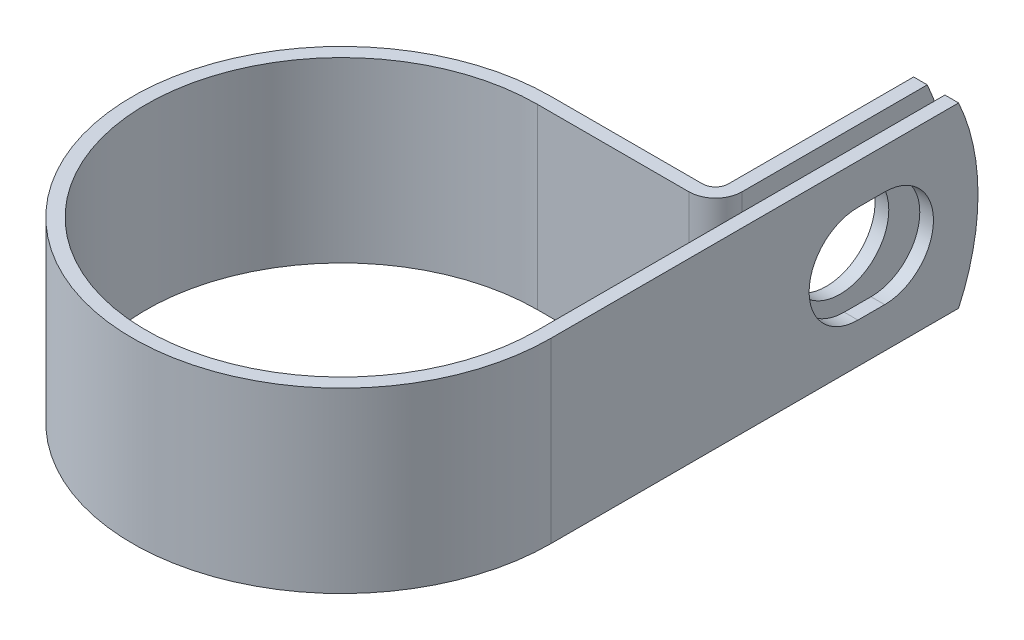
ISO-10303-21;
HEADER;
FILE_DESCRIPTION(('STEP AP214'),'2;1');
FILE_NAME('part.step','',(''),(''),'','','');
FILE_SCHEMA(('AUTOMOTIVE_DESIGN { 1 0 10303 214 1 1 1 1 }'));
ENDSEC;
DATA;
#1=APPLICATION_CONTEXT('core data for automotive mechanical design processes');
#2=APPLICATION_PROTOCOL_DEFINITION('international standard','automotive_design',2000,#1);
#3=PRODUCT_CONTEXT('',#1,'mechanical');
#4=PRODUCT('Part','Part','',(#3));
#5=PRODUCT_RELATED_PRODUCT_CATEGORY('part','',(#4));
#6=PRODUCT_DEFINITION_FORMATION('','',#4);
#7=PRODUCT_DEFINITION_CONTEXT('part definition',#1,'design');
#8=PRODUCT_DEFINITION('design','',#6,#7);
#9=PRODUCT_DEFINITION_SHAPE('','',#8);
#10=(LENGTH_UNIT() NAMED_UNIT(*) SI_UNIT(.MILLI.,.METRE.));
#11=(NAMED_UNIT(*) PLANE_ANGLE_UNIT() SI_UNIT($,.RADIAN.));
#12=(NAMED_UNIT(*) SI_UNIT($,.STERADIAN.) SOLID_ANGLE_UNIT());
#13=UNCERTAINTY_MEASURE_WITH_UNIT(LENGTH_MEASURE(1.E-05),#10,'distance_accuracy_value','');
#14=(GEOMETRIC_REPRESENTATION_CONTEXT(3) GLOBAL_UNCERTAINTY_ASSIGNED_CONTEXT((#13)) GLOBAL_UNIT_ASSIGNED_CONTEXT((#10,
#11,#12)) REPRESENTATION_CONTEXT('',''));
#15=CARTESIAN_POINT('',(0.,0.,0.));
#16=DIRECTION('',(0.,0.,1.));
#17=DIRECTION('',(1.,0.,0.));
#18=AXIS2_PLACEMENT_3D('',#15,#16,#17);
#19=CARTESIAN_POINT('',(17.4625,7.9375,0.));
#20=DIRECTION('',(-1.,0.,0.));
#21=DIRECTION('',(0.,0.,1.));
#22=AXIS2_PLACEMENT_3D('',#19,#20,#21);
#23=PLANE('',#22);
#24=DIRECTION('',(0.,0.,-1.));
#25=VECTOR('',#24,1.);
#26=CARTESIAN_POINT('',(17.4625,-4.3561,-27.3811999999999));
#27=LINE('',#26,#25);
#28=CARTESIAN_POINT('',(17.4625,-4.3561,-27.3811999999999));
#29=VERTEX_POINT('',#28);
#30=CARTESIAN_POINT('',(17.4625,-4.3561,-29.7688000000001));
#31=VERTEX_POINT('',#30);
#32=EDGE_CURVE('E236',#29,#31,#27,.T.);
#33=ORIENTED_EDGE('',*,*,#32,.T.);
#34=CARTESIAN_POINT('',(17.4625,0.,-29.7687999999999));
#35=DIRECTION('',(-1.,0.,0.));
#36=DIRECTION('',(0.,0.,1.));
#37=AXIS2_PLACEMENT_3D('',#34,#35,#36);
#38=CIRCLE('',#37,4.3561);
#39=CARTESIAN_POINT('',(17.4625,4.3561,-29.7688000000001));
#40=VERTEX_POINT('',#39);
#41=EDGE_CURVE('E257',#31,#40,#38,.F.);
#42=ORIENTED_EDGE('',*,*,#41,.T.);
#43=DIRECTION('',(0.,0.,1.));
#44=VECTOR('',#43,1.);
#45=CARTESIAN_POINT('',(17.4625,4.3561,-27.3811999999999));
#46=LINE('',#45,#44);
#47=CARTESIAN_POINT('',(17.4625,4.3561,-27.3811999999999));
#48=VERTEX_POINT('',#47);
#49=EDGE_CURVE('E253',#40,#48,#46,.T.);
#50=ORIENTED_EDGE('',*,*,#49,.T.);
#51=CARTESIAN_POINT('',(17.4625,0.,-27.3811999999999));
#52=DIRECTION('',(-1.,0.,0.));
#53=DIRECTION('',(0.,0.,1.));
#54=AXIS2_PLACEMENT_3D('',#51,#52,#53);
#55=CIRCLE('',#54,4.3561);
#56=EDGE_CURVE('E248',#48,#29,#55,.F.);
#57=ORIENTED_EDGE('',*,*,#56,.T.);
#58=EDGE_LOOP('',(#33,#42,#50,#57));
#59=FACE_BOUND('',#58,.T.);
#60=CARTESIAN_POINT('',(17.4625,0.,-19.05));
#61=DIRECTION('',(-1.,0.,0.));
#62=DIRECTION('',(0.,0.,1.));
#63=AXIS2_PLACEMENT_3D('',#60,#61,#62);
#64=CIRCLE('',#63,19.05);
#65=CARTESIAN_POINT('',(17.4625,7.9375,-36.3675804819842));
#66=VERTEX_POINT('',#65);
#67=CARTESIAN_POINT('',(17.4625,-7.9375,-36.3675804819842));
#68=VERTEX_POINT('',#67);
#69=EDGE_CURVE('E75',#66,#68,#64,.T.);
#70=ORIENTED_EDGE('',*,*,#69,.T.);
#71=DIRECTION('',(0.,0.,-1.));
#72=VECTOR('',#71,1.);
#73=CARTESIAN_POINT('',(17.4625,-7.9375,0.));
#74=LINE('',#73,#72);
#75=CARTESIAN_POINT('',(17.4625,-7.9375,0.));
#76=VERTEX_POINT('',#75);
#77=EDGE_CURVE('E271',#76,#68,#74,.T.);
#78=ORIENTED_EDGE('',*,*,#77,.F.);
#79=DIRECTION('',(0.,-1.,0.));
#80=VECTOR('',#79,1.);
#81=CARTESIAN_POINT('',(17.4625,7.9375,0.));
#82=LINE('',#81,#80);
#83=CARTESIAN_POINT('',(17.4625,7.9375,0.));
#84=VERTEX_POINT('',#83);
#85=EDGE_CURVE('E218',#84,#76,#82,.T.);
#86=ORIENTED_EDGE('',*,*,#85,.F.);
#87=DIRECTION('',(0.,0.,-1.));
#88=VECTOR('',#87,1.);
#89=CARTESIAN_POINT('',(17.4625,7.9375,-17.4625));
#90=LINE('',#89,#88);
#91=EDGE_CURVE('E273',#84,#66,#90,.T.);
#92=ORIENTED_EDGE('',*,*,#91,.T.);
#93=EDGE_LOOP('',(#70,#78,#86,#92));
#94=FACE_BOUND('',#93,.T.);
#95=ADVANCED_FACE('F54',(#59,#94),#23,.T.);
#96=CARTESIAN_POINT('',(15.8877,7.9375,-38.1));
#97=DIRECTION('',(1.,0.,0.));
#98=DIRECTION('',(0.,0.,-1.));
#99=AXIS2_PLACEMENT_3D('',#96,#97,#98);
#100=PLANE('',#99);
#101=CARTESIAN_POINT('',(15.8877,0.,-28.575));
#102=DIRECTION('',(1.,0.,0.));
#103=DIRECTION('',(0.,0.,-1.));
#104=AXIS2_PLACEMENT_3D('',#101,#102,#103);
#105=CIRCLE('',#104,4.3561);
#106=CARTESIAN_POINT('',(15.8877,0.,-32.9311));
#107=VERTEX_POINT('',#106);
#108=EDGE_CURVE('E268',#107,#107,#105,.F.);
#109=ORIENTED_EDGE('',*,*,#108,.T.);
#110=EDGE_LOOP('',(#109));
#111=FACE_BOUND('',#110,.T.);
#112=DIRECTION('',(0.,0.,1.));
#113=VECTOR('',#112,1.);
#114=CARTESIAN_POINT('',(15.8877,-7.9375,-38.1));
#115=LINE('',#114,#113);
#116=CARTESIAN_POINT('',(15.8877,-7.9375,-36.3675804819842));
#117=VERTEX_POINT('',#116);
#118=CARTESIAN_POINT('',(15.8877,-7.9375,-19.83994));
#119=VERTEX_POINT('',#118);
#120=EDGE_CURVE('E184',#117,#119,#115,.T.);
#121=ORIENTED_EDGE('',*,*,#120,.F.);
#122=CARTESIAN_POINT('',(15.8877,0.,-19.05));
#123=DIRECTION('',(1.,0.,0.));
#124=DIRECTION('',(0.,0.,-1.));
#125=AXIS2_PLACEMENT_3D('',#122,#123,#124);
#126=CIRCLE('',#125,19.05);
#127=CARTESIAN_POINT('',(15.8877,7.9375,-36.3675804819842));
#128=VERTEX_POINT('',#127);
#129=EDGE_CURVE('E176',#117,#128,#126,.T.);
#130=ORIENTED_EDGE('',*,*,#129,.T.);
#131=DIRECTION('',(0.,0.,1.));
#132=VECTOR('',#131,1.);
#133=CARTESIAN_POINT('',(15.8877,7.9375,-38.1));
#134=LINE('',#133,#132);
#135=CARTESIAN_POINT('',(15.8877,7.9375,-19.83994));
#136=VERTEX_POINT('',#135);
#137=EDGE_CURVE('E224',#128,#136,#134,.T.);
#138=ORIENTED_EDGE('',*,*,#137,.T.);
#139=DIRECTION('',(0.,-1.,0.));
#140=VECTOR('',#139,1.);
#141=CARTESIAN_POINT('',(15.8877,7.9375,-19.83994));
#142=LINE('',#141,#140);
#143=EDGE_CURVE('E211',#136,#119,#142,.T.);
#144=ORIENTED_EDGE('',*,*,#143,.T.);
#145=EDGE_LOOP('',(#121,#130,#138,#144));
#146=FACE_BOUND('',#145,.T.);
#147=ADVANCED_FACE('F226',(#111,#146),#100,.T.);
#148=CARTESIAN_POINT('',(14.6685,7.9375,-38.1));
#149=DIRECTION('',(1.,0.,0.));
#150=DIRECTION('',(0.,0.,-1.));
#151=AXIS2_PLACEMENT_3D('',#148,#149,#150);
#152=PLANE('',#151);
#153=CARTESIAN_POINT('',(14.6685,0.,-28.575));
#154=DIRECTION('',(-1.,0.,0.));
#155=DIRECTION('',(0.,0.,1.));
#156=AXIS2_PLACEMENT_3D('',#153,#154,#155);
#157=CIRCLE('',#156,4.3561);
#158=CARTESIAN_POINT('',(14.6685,0.,-24.2189));
#159=VERTEX_POINT('',#158);
#160=EDGE_CURVE('E265',#159,#159,#157,.T.);
#161=ORIENTED_EDGE('',*,*,#160,.F.);
#162=EDGE_LOOP('',(#161));
#163=FACE_BOUND('',#162,.T.);
#164=CARTESIAN_POINT('',(14.6685,0.,-19.05));
#165=DIRECTION('',(-1.,0.,0.));
#166=DIRECTION('',(0.,0.,1.));
#167=AXIS2_PLACEMENT_3D('',#164,#165,#166);
#168=CIRCLE('',#167,19.05);
#169=CARTESIAN_POINT('',(14.6685,7.9375,-36.3675804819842));
#170=VERTEX_POINT('',#169);
#171=CARTESIAN_POINT('',(14.6685,-7.9375,-36.3675804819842));
#172=VERTEX_POINT('',#171);
#173=EDGE_CURVE('E67',#170,#172,#168,.T.);
#174=ORIENTED_EDGE('',*,*,#173,.T.);
#175=DIRECTION('',(0.,0.,-1.));
#176=VECTOR('',#175,1.);
#177=CARTESIAN_POINT('',(14.6685,-7.9375,-38.1));
#178=LINE('',#177,#176);
#179=CARTESIAN_POINT('',(14.6685,-7.9375,-19.83994));
#180=VERTEX_POINT('',#179);
#181=EDGE_CURVE('E167',#172,#180,#178,.F.);
#182=ORIENTED_EDGE('',*,*,#181,.T.);
#183=DIRECTION('',(0.,-1.,0.));
#184=VECTOR('',#183,1.);
#185=CARTESIAN_POINT('',(14.6685,7.9375,-19.83994));
#186=LINE('',#185,#184);
#187=CARTESIAN_POINT('',(14.6685,7.9375,-19.83994));
#188=VERTEX_POINT('',#187);
#189=EDGE_CURVE('E209',#188,#180,#186,.T.);
#190=ORIENTED_EDGE('',*,*,#189,.F.);
#191=DIRECTION('',(0.,0.,-1.));
#192=VECTOR('',#191,1.);
#193=CARTESIAN_POINT('',(14.6685,7.9375,-38.1));
#194=LINE('',#193,#192);
#195=EDGE_CURVE('E169',#170,#188,#194,.F.);
#196=ORIENTED_EDGE('',*,*,#195,.F.);
#197=EDGE_LOOP('',(#174,#182,#190,#196));
#198=FACE_BOUND('',#197,.T.);
#199=ADVANCED_FACE('F164',(#163,#198),#152,.F.);
#200=CARTESIAN_POINT('',(18.6817,7.9375,0.));
#201=DIRECTION('',(-1.,0.,0.));
#202=DIRECTION('',(0.,0.,1.));
#203=AXIS2_PLACEMENT_3D('',#200,#201,#202);
#204=PLANE('',#203);
#205=CARTESIAN_POINT('',(18.6817,0.,-29.7687999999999));
#206=DIRECTION('',(1.,0.,0.));
#207=DIRECTION('',(0.,0.,-1.));
#208=AXIS2_PLACEMENT_3D('',#205,#206,#207);
#209=CIRCLE('',#208,4.3561);
#210=CARTESIAN_POINT('',(18.6817,-4.3561,-29.7688000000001));
#211=VERTEX_POINT('',#210);
#212=CARTESIAN_POINT('',(18.6817,4.3561,-29.7688000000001));
#213=VERTEX_POINT('',#212);
#214=EDGE_CURVE('E237',#211,#213,#209,.T.);
#215=ORIENTED_EDGE('',*,*,#214,.F.);
#216=DIRECTION('',(0.,0.,-1.));
#217=VECTOR('',#216,1.);
#218=CARTESIAN_POINT('',(18.6817,-4.3561,-27.3811999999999));
#219=LINE('',#218,#217);
#220=CARTESIAN_POINT('',(18.6817,-4.3561,-27.3811999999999));
#221=VERTEX_POINT('',#220);
#222=EDGE_CURVE('E240',#221,#211,#219,.T.);
#223=ORIENTED_EDGE('',*,*,#222,.F.);
#224=CARTESIAN_POINT('',(18.6817,0.,-27.3811999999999));
#225=DIRECTION('',(1.,0.,0.));
#226=DIRECTION('',(0.,0.,-1.));
#227=AXIS2_PLACEMENT_3D('',#224,#225,#226);
#228=CIRCLE('',#227,4.3561);
#229=CARTESIAN_POINT('',(18.6817,4.3561,-27.3811999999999));
#230=VERTEX_POINT('',#229);
#231=EDGE_CURVE('E230',#230,#221,#228,.T.);
#232=ORIENTED_EDGE('',*,*,#231,.F.);
#233=DIRECTION('',(0.,0.,1.));
#234=VECTOR('',#233,1.);
#235=CARTESIAN_POINT('',(18.6817,4.3561,-27.3811999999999));
#236=LINE('',#235,#234);
#237=EDGE_CURVE('E234',#213,#230,#236,.T.);
#238=ORIENTED_EDGE('',*,*,#237,.F.);
#239=EDGE_LOOP('',(#215,#223,#232,#238));
#240=FACE_BOUND('',#239,.T.);
#241=DIRECTION('',(0.,0.,-1.));
#242=VECTOR('',#241,1.);
#243=CARTESIAN_POINT('',(18.6817,-7.9375,0.));
#244=LINE('',#243,#242);
#245=CARTESIAN_POINT('',(18.6817,-7.9375,0.));
#246=VERTEX_POINT('',#245);
#247=CARTESIAN_POINT('',(18.6817,-7.9375,-36.3675804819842));
#248=VERTEX_POINT('',#247);
#249=EDGE_CURVE('E195',#246,#248,#244,.T.);
#250=ORIENTED_EDGE('',*,*,#249,.T.);
#251=CARTESIAN_POINT('',(18.6817,0.,-19.05));
#252=DIRECTION('',(-1.,0.,0.));
#253=DIRECTION('',(0.,0.,1.));
#254=AXIS2_PLACEMENT_3D('',#251,#252,#253);
#255=CIRCLE('',#254,19.05);
#256=CARTESIAN_POINT('',(18.6817,7.9375,-36.3675804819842));
#257=VERTEX_POINT('',#256);
#258=EDGE_CURVE('E170',#257,#248,#255,.T.);
#259=ORIENTED_EDGE('',*,*,#258,.F.);
#260=DIRECTION('',(0.,0.,-1.));
#261=VECTOR('',#260,1.);
#262=CARTESIAN_POINT('',(18.6817,7.9375,-17.4625));
#263=LINE('',#262,#261);
#264=CARTESIAN_POINT('',(18.6817,7.9375,0.));
#265=VERTEX_POINT('',#264);
#266=EDGE_CURVE('E198',#265,#257,#263,.T.);
#267=ORIENTED_EDGE('',*,*,#266,.F.);
#268=DIRECTION('',(0.,-1.,0.));
#269=VECTOR('',#268,1.);
#270=CARTESIAN_POINT('',(18.6817,7.9375,0.));
#271=LINE('',#270,#269);
#272=EDGE_CURVE('E199',#265,#246,#271,.T.);
#273=ORIENTED_EDGE('',*,*,#272,.T.);
#274=EDGE_LOOP('',(#250,#259,#267,#273));
#275=FACE_BOUND('',#274,.T.);
#276=ADVANCED_FACE('F321',(#240,#275),#204,.F.);
#277=CARTESIAN_POINT('',(0.,-7.9375,0.));
#278=DIRECTION('',(0.,1.,0.));
#279=DIRECTION('',(1.,0.,0.));
#280=AXIS2_PLACEMENT_3D('',#277,#278,#279);
#281=PLANE('',#280);
#282=DIRECTION('',(-1.,0.,0.));
#283=VECTOR('',#282,1.);
#284=CARTESIAN_POINT('',(18.6817,-7.9375,-36.3675804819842));
#285=LINE('',#284,#283);
#286=EDGE_CURVE('E171',#248,#68,#285,.T.);
#287=ORIENTED_EDGE('',*,*,#286,.F.);
#288=ORIENTED_EDGE('',*,*,#249,.F.);
#289=CARTESIAN_POINT('',(0.,-7.9375,0.));
#290=DIRECTION('',(0.,1.,0.));
#291=DIRECTION('',(1.,0.,0.));
#292=AXIS2_PLACEMENT_3D('',#289,#290,#291);
#293=CIRCLE('',#292,18.6817);
#294=CARTESIAN_POINT('',(0.,-7.9375,-18.6817));
#295=VERTEX_POINT('',#294);
#296=EDGE_CURVE('E193',#295,#246,#293,.T.);
#297=ORIENTED_EDGE('',*,*,#296,.F.);
#298=DIRECTION('',(1.,0.,0.));
#299=VECTOR('',#298,1.);
#300=CARTESIAN_POINT('',(0.,-7.9375,-18.6817));
#301=LINE('',#300,#299);
#302=CARTESIAN_POINT('',(13.51026,-7.9375,-18.6817));
#303=VERTEX_POINT('',#302);
#304=EDGE_CURVE('E186',#303,#295,#301,.F.);
#305=ORIENTED_EDGE('',*,*,#304,.F.);
#306=CARTESIAN_POINT('',(13.51026,-7.9375,-19.83994));
#307=DIRECTION('',(0.,1.,0.));
#308=DIRECTION('',(1.,0.,0.));
#309=AXIS2_PLACEMENT_3D('',#306,#307,#308);
#310=CIRCLE('',#309,1.15824);
#311=EDGE_CURVE('E183',#180,#303,#310,.F.);
#312=ORIENTED_EDGE('',*,*,#311,.F.);
#313=ORIENTED_EDGE('',*,*,#181,.F.);
#314=DIRECTION('',(-1.,0.,0.));
#315=VECTOR('',#314,1.);
#316=CARTESIAN_POINT('',(18.6817,-7.9375,-36.3675804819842));
#317=LINE('',#316,#315);
#318=EDGE_CURVE('E12',#117,#172,#317,.T.);
#319=ORIENTED_EDGE('',*,*,#318,.F.);
#320=ORIENTED_EDGE('',*,*,#120,.T.);
#321=CARTESIAN_POINT('',(13.51026,-7.9375,-19.83994));
#322=DIRECTION('',(0.,-1.,0.));
#323=DIRECTION('',(0.,0.,1.));
#324=AXIS2_PLACEMENT_3D('',#321,#322,#323);
#325=CIRCLE('',#324,2.37744);
#326=CARTESIAN_POINT('',(13.51026,-7.9375,-17.4625));
#327=VERTEX_POINT('',#326);
#328=EDGE_CURVE('E188',#119,#327,#325,.T.);
#329=ORIENTED_EDGE('',*,*,#328,.T.);
#330=DIRECTION('',(-1.,0.,0.));
#331=VECTOR('',#330,1.);
#332=CARTESIAN_POINT('',(0.,-7.9375,-17.4625));
#333=LINE('',#332,#331);
#334=CARTESIAN_POINT('',(0.,-7.9375,-17.4625));
#335=VERTEX_POINT('',#334);
#336=EDGE_CURVE('E298',#327,#335,#333,.T.);
#337=ORIENTED_EDGE('',*,*,#336,.T.);
#338=CARTESIAN_POINT('',(0.,-7.9375,0.));
#339=DIRECTION('',(0.,1.,0.));
#340=DIRECTION('',(0.,0.,1.));
#341=AXIS2_PLACEMENT_3D('',#338,#339,#340);
#342=CIRCLE('',#341,17.4625);
#343=EDGE_CURVE('E295',#335,#76,#342,.T.);
#344=ORIENTED_EDGE('',*,*,#343,.T.);
#345=ORIENTED_EDGE('',*,*,#77,.T.);
#346=EDGE_LOOP('',(#287,#288,#297,#305,#312,#313,#319,#320,#329,#337,#344,#345));
#347=FACE_BOUND('',#346,.T.);
#348=ADVANCED_FACE('F181',(#347),#281,.F.);
#349=CARTESIAN_POINT('',(0.,7.9375,0.));
#350=DIRECTION('',(0.,1.,0.));
#351=DIRECTION('',(1.,0.,0.));
#352=AXIS2_PLACEMENT_3D('',#349,#350,#351);
#353=PLANE('',#352);
#354=ORIENTED_EDGE('',*,*,#266,.T.);
#355=DIRECTION('',(-1.,0.,0.));
#356=VECTOR('',#355,1.);
#357=CARTESIAN_POINT('',(18.6817,7.9375,-36.3675804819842));
#358=LINE('',#357,#356);
#359=EDGE_CURVE('E228',#257,#66,#358,.T.);
#360=ORIENTED_EDGE('',*,*,#359,.T.);
#361=ORIENTED_EDGE('',*,*,#91,.F.);
#362=CARTESIAN_POINT('',(0.,7.9375,0.));
#363=DIRECTION('',(0.,1.,0.));
#364=DIRECTION('',(0.,0.,1.));
#365=AXIS2_PLACEMENT_3D('',#362,#363,#364);
#366=CIRCLE('',#365,17.4625);
#367=CARTESIAN_POINT('',(0.,7.9375,-17.4625));
#368=VERTEX_POINT('',#367);
#369=EDGE_CURVE('E276',#368,#84,#366,.T.);
#370=ORIENTED_EDGE('',*,*,#369,.F.);
#371=DIRECTION('',(-1.,0.,0.));
#372=VECTOR('',#371,1.);
#373=CARTESIAN_POINT('',(0.,7.9375,-17.4625));
#374=LINE('',#373,#372);
#375=CARTESIAN_POINT('',(13.51026,7.9375,-17.4625));
#376=VERTEX_POINT('',#375);
#377=EDGE_CURVE('E279',#376,#368,#374,.T.);
#378=ORIENTED_EDGE('',*,*,#377,.F.);
#379=CARTESIAN_POINT('',(13.51026,7.9375,-19.83994));
#380=DIRECTION('',(0.,-1.,0.));
#381=DIRECTION('',(0.,0.,1.));
#382=AXIS2_PLACEMENT_3D('',#379,#380,#381);
#383=CIRCLE('',#382,2.37744);
#384=EDGE_CURVE('E282',#136,#376,#383,.T.);
#385=ORIENTED_EDGE('',*,*,#384,.F.);
#386=ORIENTED_EDGE('',*,*,#137,.F.);
#387=DIRECTION('',(-1.,0.,0.));
#388=VECTOR('',#387,1.);
#389=CARTESIAN_POINT('',(18.6817,7.9375,-36.3675804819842));
#390=LINE('',#389,#388);
#391=EDGE_CURVE('E61',#128,#170,#390,.T.);
#392=ORIENTED_EDGE('',*,*,#391,.T.);
#393=ORIENTED_EDGE('',*,*,#195,.T.);
#394=CARTESIAN_POINT('',(13.51026,7.9375,-19.83994));
#395=DIRECTION('',(0.,1.,0.));
#396=DIRECTION('',(1.,0.,0.));
#397=AXIS2_PLACEMENT_3D('',#394,#395,#396);
#398=CIRCLE('',#397,1.15824);
#399=CARTESIAN_POINT('',(13.51026,7.9375,-18.6817));
#400=VERTEX_POINT('',#399);
#401=EDGE_CURVE('E287',#188,#400,#398,.F.);
#402=ORIENTED_EDGE('',*,*,#401,.T.);
#403=DIRECTION('',(1.,0.,0.));
#404=VECTOR('',#403,1.);
#405=CARTESIAN_POINT('',(0.,7.9375,-18.6817));
#406=LINE('',#405,#404);
#407=CARTESIAN_POINT('',(0.,7.9375,-18.6817));
#408=VERTEX_POINT('',#407);
#409=EDGE_CURVE('E289',#400,#408,#406,.F.);
#410=ORIENTED_EDGE('',*,*,#409,.T.);
#411=CARTESIAN_POINT('',(0.,7.9375,0.));
#412=DIRECTION('',(0.,1.,0.));
#413=DIRECTION('',(1.,0.,0.));
#414=AXIS2_PLACEMENT_3D('',#411,#412,#413);
#415=CIRCLE('',#414,18.6817);
#416=EDGE_CURVE('E203',#408,#265,#415,.T.);
#417=ORIENTED_EDGE('',*,*,#416,.T.);
#418=EDGE_LOOP('',(#354,#360,#361,#370,#378,#385,#386,#392,#393,#402,#410,#417));
#419=FACE_BOUND('',#418,.T.);
#420=ADVANCED_FACE('F222',(#419),#353,.T.);
#421=CARTESIAN_POINT('',(0.,7.9375,0.));
#422=DIRECTION('',(0.,-1.,0.));
#423=DIRECTION('',(0.,0.,-1.));
#424=AXIS2_PLACEMENT_3D('',#421,#422,#423);
#425=CYLINDRICAL_SURFACE('',#424,17.4625);
#426=ORIENTED_EDGE('',*,*,#343,.F.);
#427=DIRECTION('',(0.,-1.,0.));
#428=VECTOR('',#427,1.);
#429=CARTESIAN_POINT('',(0.,7.9375,-17.4625));
#430=LINE('',#429,#428);
#431=EDGE_CURVE('E216',#368,#335,#430,.T.);
#432=ORIENTED_EDGE('',*,*,#431,.F.);
#433=ORIENTED_EDGE('',*,*,#369,.T.);
#434=ORIENTED_EDGE('',*,*,#85,.T.);
#435=EDGE_LOOP('',(#426,#432,#433,#434));
#436=FACE_BOUND('',#435,.T.);
#437=ADVANCED_FACE('F311',(#436),#425,.F.);
#438=CARTESIAN_POINT('',(0.,7.9375,-17.4625));
#439=DIRECTION('',(0.,0.,1.));
#440=DIRECTION('',(1.,0.,0.));
#441=AXIS2_PLACEMENT_3D('',#438,#439,#440);
#442=PLANE('',#441);
#443=ORIENTED_EDGE('',*,*,#336,.F.);
#444=DIRECTION('',(0.,-1.,0.));
#445=VECTOR('',#444,1.);
#446=CARTESIAN_POINT('',(13.51026,7.9375,-17.4625));
#447=LINE('',#446,#445);
#448=EDGE_CURVE('E214',#376,#327,#447,.T.);
#449=ORIENTED_EDGE('',*,*,#448,.F.);
#450=ORIENTED_EDGE('',*,*,#377,.T.);
#451=ORIENTED_EDGE('',*,*,#431,.T.);
#452=EDGE_LOOP('',(#443,#449,#450,#451));
#453=FACE_BOUND('',#452,.T.);
#454=ADVANCED_FACE('F307',(#453),#442,.T.);
#455=CARTESIAN_POINT('',(13.51026,7.9375,-19.83994));
#456=DIRECTION('',(0.,-1.,0.));
#457=DIRECTION('',(0.,0.,-1.));
#458=AXIS2_PLACEMENT_3D('',#455,#456,#457);
#459=CYLINDRICAL_SURFACE('',#458,2.37744);
#460=ORIENTED_EDGE('',*,*,#328,.F.);
#461=ORIENTED_EDGE('',*,*,#143,.F.);
#462=ORIENTED_EDGE('',*,*,#384,.T.);
#463=ORIENTED_EDGE('',*,*,#448,.T.);
#464=EDGE_LOOP('',(#460,#461,#462,#463));
#465=FACE_BOUND('',#464,.T.);
#466=ADVANCED_FACE('F304',(#465),#459,.T.);
#467=CARTESIAN_POINT('',(13.51026,7.9375,-19.83994));
#468=DIRECTION('',(0.,-1.,0.));
#469=DIRECTION('',(0.,0.,-1.));
#470=AXIS2_PLACEMENT_3D('',#467,#468,#469);
#471=CYLINDRICAL_SURFACE('',#470,1.15824);
#472=ORIENTED_EDGE('',*,*,#311,.T.);
#473=DIRECTION('',(0.,-1.,0.));
#474=VECTOR('',#473,1.);
#475=CARTESIAN_POINT('',(13.51026,7.9375,-18.6817));
#476=LINE('',#475,#474);
#477=EDGE_CURVE('E206',#400,#303,#476,.T.);
#478=ORIENTED_EDGE('',*,*,#477,.F.);
#479=ORIENTED_EDGE('',*,*,#401,.F.);
#480=ORIENTED_EDGE('',*,*,#189,.T.);
#481=EDGE_LOOP('',(#472,#478,#479,#480));
#482=FACE_BOUND('',#481,.T.);
#483=ADVANCED_FACE('F334',(#482),#471,.F.);
#484=CARTESIAN_POINT('',(0.,7.9375,-18.6817));
#485=DIRECTION('',(0.,0.,1.));
#486=DIRECTION('',(1.,0.,0.));
#487=AXIS2_PLACEMENT_3D('',#484,#485,#486);
#488=PLANE('',#487);
#489=ORIENTED_EDGE('',*,*,#304,.T.);
#490=DIRECTION('',(0.,-1.,0.));
#491=VECTOR('',#490,1.);
#492=CARTESIAN_POINT('',(0.,7.9375,-18.6817));
#493=LINE('',#492,#491);
#494=EDGE_CURVE('E202',#408,#295,#493,.T.);
#495=ORIENTED_EDGE('',*,*,#494,.F.);
#496=ORIENTED_EDGE('',*,*,#409,.F.);
#497=ORIENTED_EDGE('',*,*,#477,.T.);
#498=EDGE_LOOP('',(#489,#495,#496,#497));
#499=FACE_BOUND('',#498,.T.);
#500=ADVANCED_FACE('F330',(#499),#488,.F.);
#501=CARTESIAN_POINT('',(0.,7.9375,0.));
#502=DIRECTION('',(0.,-1.,0.));
#503=DIRECTION('',(0.,0.,-1.));
#504=AXIS2_PLACEMENT_3D('',#501,#502,#503);
#505=CYLINDRICAL_SURFACE('',#504,18.6817);
#506=ORIENTED_EDGE('',*,*,#296,.T.);
#507=ORIENTED_EDGE('',*,*,#272,.F.);
#508=ORIENTED_EDGE('',*,*,#416,.F.);
#509=ORIENTED_EDGE('',*,*,#494,.T.);
#510=EDGE_LOOP('',(#506,#507,#508,#509));
#511=FACE_BOUND('',#510,.T.);
#512=ADVANCED_FACE('F327',(#511),#505,.T.);
#513=CARTESIAN_POINT('',(28.2086113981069,0.,-28.575));
#514=DIRECTION('',(-1.,0.,0.));
#515=DIRECTION('',(0.,0.,1.));
#516=AXIS2_PLACEMENT_3D('',#513,#514,#515);
#517=CYLINDRICAL_SURFACE('',#516,4.3561);
#518=ORIENTED_EDGE('',*,*,#160,.T.);
#519=EDGE_LOOP('',(#518));
#520=FACE_BOUND('',#519,.T.);
#521=ORIENTED_EDGE('',*,*,#108,.F.);
#522=EDGE_LOOP('',(#521));
#523=FACE_BOUND('',#522,.T.);
#524=ADVANCED_FACE('F379',(#520,#523),#517,.F.);
#525=CARTESIAN_POINT('',(3.35193697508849,-4.3561,-27.3811999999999));
#526=DIRECTION('',(0.,-1.,0.));
#527=DIRECTION('',(0.,0.,-1.));
#528=AXIS2_PLACEMENT_3D('',#525,#526,#527);
#529=PLANE('',#528);
#530=DIRECTION('',(1.,0.,0.));
#531=VECTOR('',#530,1.);
#532=CARTESIAN_POINT('',(3.35193697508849,-4.3561,-27.3811999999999));
#533=LINE('',#532,#531);
#534=EDGE_CURVE('E251',#29,#221,#533,.T.);
#535=ORIENTED_EDGE('',*,*,#534,.T.);
#536=ORIENTED_EDGE('',*,*,#222,.T.);
#537=DIRECTION('',(1.,0.,0.));
#538=VECTOR('',#537,1.);
#539=CARTESIAN_POINT('',(3.35193697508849,-4.3561,-29.7688000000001));
#540=LINE('',#539,#538);
#541=EDGE_CURVE('E247',#31,#211,#540,.T.);
#542=ORIENTED_EDGE('',*,*,#541,.F.);
#543=ORIENTED_EDGE('',*,*,#32,.F.);
#544=EDGE_LOOP('',(#535,#536,#542,#543));
#545=FACE_BOUND('',#544,.T.);
#546=ADVANCED_FACE('F354',(#545),#529,.F.);
#547=CARTESIAN_POINT('',(3.35193697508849,0.,-29.7687999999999));
#548=DIRECTION('',(1.,0.,0.));
#549=DIRECTION('',(0.,0.,-1.));
#550=AXIS2_PLACEMENT_3D('',#547,#548,#549);
#551=CYLINDRICAL_SURFACE('',#550,4.3561);
#552=ORIENTED_EDGE('',*,*,#541,.T.);
#553=ORIENTED_EDGE('',*,*,#214,.T.);
#554=DIRECTION('',(1.,0.,0.));
#555=VECTOR('',#554,1.);
#556=CARTESIAN_POINT('',(3.35193697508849,4.3561,-29.7688000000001));
#557=LINE('',#556,#555);
#558=EDGE_CURVE('E256',#40,#213,#557,.T.);
#559=ORIENTED_EDGE('',*,*,#558,.F.);
#560=ORIENTED_EDGE('',*,*,#41,.F.);
#561=EDGE_LOOP('',(#552,#553,#559,#560));
#562=FACE_BOUND('',#561,.T.);
#563=ADVANCED_FACE('F358',(#562),#551,.F.);
#564=CARTESIAN_POINT('',(3.35193697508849,4.3561,-27.3811999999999));
#565=DIRECTION('',(0.,1.,0.));
#566=DIRECTION('',(0.,0.,1.));
#567=AXIS2_PLACEMENT_3D('',#564,#565,#566);
#568=PLANE('',#567);
#569=ORIENTED_EDGE('',*,*,#558,.T.);
#570=ORIENTED_EDGE('',*,*,#237,.T.);
#571=DIRECTION('',(1.,0.,0.));
#572=VECTOR('',#571,1.);
#573=CARTESIAN_POINT('',(3.35193697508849,4.3561,-27.3811999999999));
#574=LINE('',#573,#572);
#575=EDGE_CURVE('E252',#48,#230,#574,.T.);
#576=ORIENTED_EDGE('',*,*,#575,.F.);
#577=ORIENTED_EDGE('',*,*,#49,.F.);
#578=EDGE_LOOP('',(#569,#570,#576,#577));
#579=FACE_BOUND('',#578,.T.);
#580=ADVANCED_FACE('F362',(#579),#568,.F.);
#581=CARTESIAN_POINT('',(3.35193697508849,0.,-27.3811999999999));
#582=DIRECTION('',(1.,0.,0.));
#583=DIRECTION('',(0.,0.,-1.));
#584=AXIS2_PLACEMENT_3D('',#581,#582,#583);
#585=CYLINDRICAL_SURFACE('',#584,4.3561);
#586=ORIENTED_EDGE('',*,*,#575,.T.);
#587=ORIENTED_EDGE('',*,*,#231,.T.);
#588=ORIENTED_EDGE('',*,*,#534,.F.);
#589=ORIENTED_EDGE('',*,*,#56,.F.);
#590=EDGE_LOOP('',(#586,#587,#588,#589));
#591=FACE_BOUND('',#590,.T.);
#592=ADVANCED_FACE('F366',(#591),#585,.F.);
#593=CARTESIAN_POINT('',(18.6817,0.,-19.05));
#594=DIRECTION('',(-1.,0.,0.));
#595=DIRECTION('',(0.,0.,1.));
#596=AXIS2_PLACEMENT_3D('',#593,#594,#595);
#597=CYLINDRICAL_SURFACE('',#596,19.05);
#598=ORIENTED_EDGE('',*,*,#129,.F.);
#599=ORIENTED_EDGE('',*,*,#318,.T.);
#600=ORIENTED_EDGE('',*,*,#173,.F.);
#601=ORIENTED_EDGE('',*,*,#391,.F.);
#602=EDGE_LOOP('',(#598,#599,#600,#601));
#603=FACE_BOUND('',#602,.T.);
#604=ADVANCED_FACE('F174',(#603),#597,.T.);
#605=ORIENTED_EDGE('',*,*,#359,.F.);
#606=ORIENTED_EDGE('',*,*,#258,.T.);
#607=ORIENTED_EDGE('',*,*,#286,.T.);
#608=ORIENTED_EDGE('',*,*,#69,.F.);
#609=EDGE_LOOP('',(#605,#606,#607,#608));
#610=FACE_BOUND('',#609,.T.);
#611=ADVANCED_FACE('F316',(#610),#597,.T.);
#612=CLOSED_SHELL('',(#95,#147,#199,#276,#348,#420,#437,#454,#466,#483,#500,#512,#524,#546,#563,
#580,#592,#604,#611));
#613=MANIFOLD_SOLID_BREP('B2',#612);
#614=ADVANCED_BREP_SHAPE_REPRESENTATION('',(#18,#613),#14);
#615=SHAPE_DEFINITION_REPRESENTATION(#9,#614);
ENDSEC;
END-ISO-10303-21;
